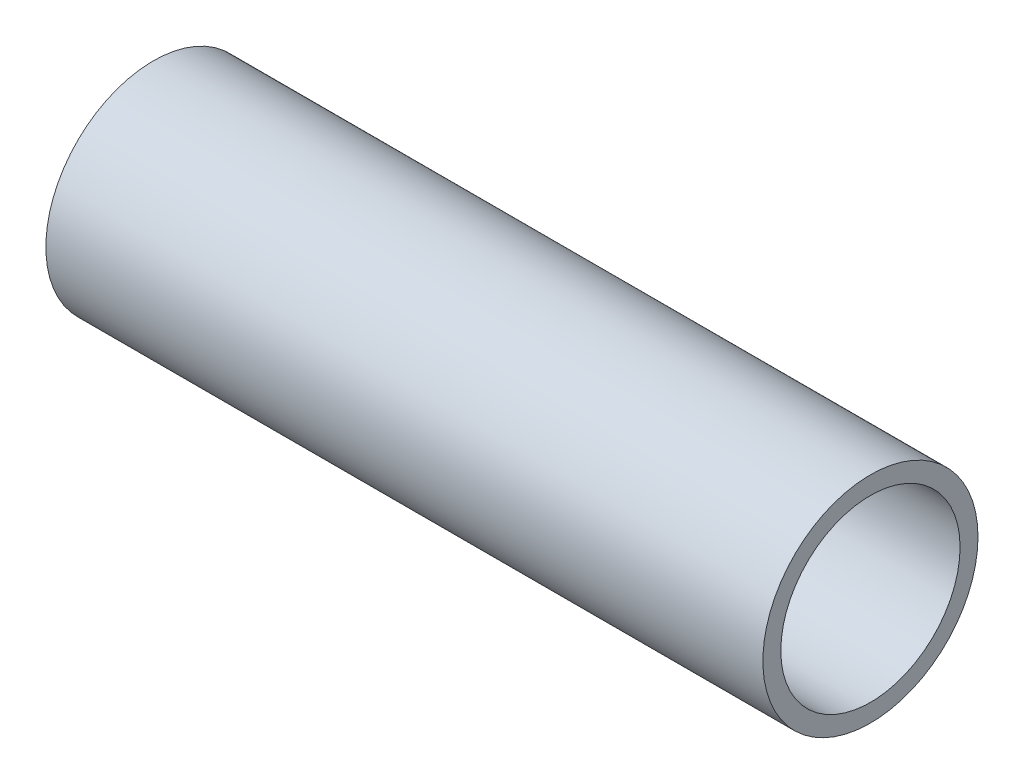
from build123d import *

# Parameters (mm, degrees)
SKETCH1_R           = 60
SKETCH1_R_2         = 50
BOSS_EXTRUDE1_DEPTH = 400
SKETCH2_R           = 40
CUT_EXTRUDE1_DEPTH  = 400


with BuildPart() as part:
    # Sketch1 → Boss-Extrude1 (new body)
    with BuildSketch(Plane(origin=(0, 0, 0), x_dir=(0, 0, -1), z_dir=(1, 0, 0))):
        Circle(SKETCH1_R)
        Circle(SKETCH1_R_2, mode=Mode.SUBTRACT)
    extrude(amount=BOSS_EXTRUDE1_DEPTH)

    # Sketch2 → Cut-Extrude1 (cut)
    with BuildSketch(Plane.XY):
        with Locations((200, 0)):
            Circle(SKETCH2_R)
    extrude(amount=-CUT_EXTRUDE1_DEPTH, mode=Mode.SUBTRACT)


solid = part.part
